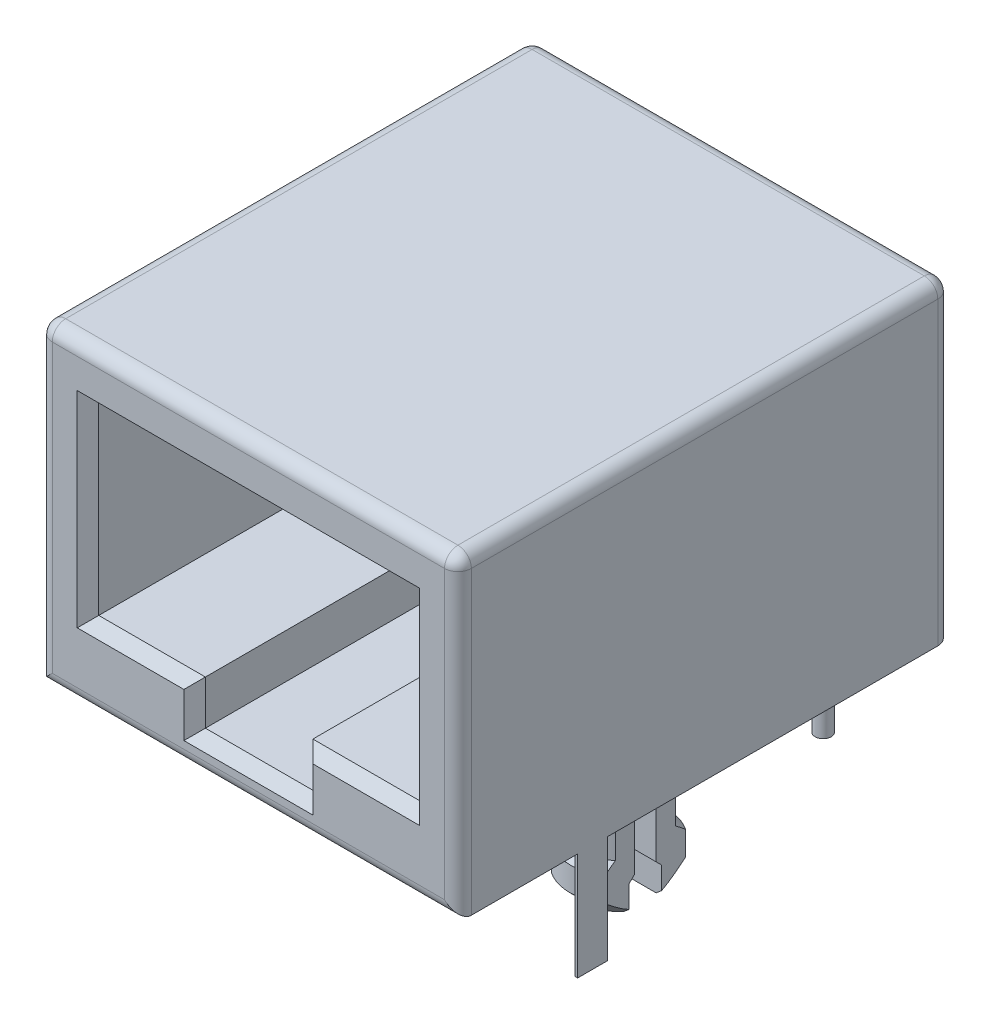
from build123d import *

# Parameters (mm, degrees)
SKETCH_1_W               = 15.6
SKETCH_1_H               = 18.36
EXTRUDE_1_DEPTH          = 11.68
CUT_EXTRUDE_1_DEPTH      = 12
SKETCH_3_R               = 0.3
SKETCH_3_W               = 0.1
SKETCH_3_H               = 1.11
EXTRUDE_2_DEPTH          = 4
CUT_EXTRUDE_2_DEPTH      = 24.116055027
CUT_EXTRUDE_2_DEPTH_BACK = 24.116055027
EXTRUDE_1_2_DEPTH        = 0.3
PATTERN_LINEAR_1_COUNT   = 8
PATTERN_LINEAR_1_PITCH   = 1.27
FILLET_1_R               = 0.5
CHAMFER_1_SIZE           = 0.4


with BuildPart() as part:
    # Sketch 1 → Extrude 1 (new body)
    with BuildSketch(Plane(origin=(0, 0, 0), x_dir=(1, 0, 0), z_dir=(0, 1, 0))):
        with Locations((0, 9.18)):
            Rectangle(SKETCH_1_W, SKETCH_1_H)
    extrude(amount=EXTRUDE_1_DEPTH)

    # Sketch 2 → Cut-Extrude 1 (cut)
    with BuildSketch(Plane.XY):
        Polygon((2, 2.83), (5.97, 2.83), (5.97, 9.68), (-5.97, 9.68), (-5.97, 2.83), (-2, 2.83), (-2, 1.18), (2, 1.18), align=None)
    extrude(amount=-CUT_EXTRUDE_1_DEPTH, mode=Mode.SUBTRACT)

    # Sketch 3 → Extrude 2 (add)
    with BuildSketch(Plane.XZ):
        with Locations(Location((4.445, -16.95, 0), (0, 0, 270))):
            Circle(SKETCH_3_R)
        with Locations(Location((1.905, -16.95, 0), (0, 0, 270))):
            Circle(SKETCH_3_R)
        with Locations(Location((-0.635, -16.95, 0), (0, 0, 270))):
            Circle(SKETCH_3_R)
        with Locations(Location((-3.175, -16.95, 0), (0, 0, 270))):
            Circle(SKETCH_3_R)
        with Locations(Location((3.175, -14.41, 0), (0, 0, 270))):
            Circle(SKETCH_3_R)
        with Locations(Location((0.635, -14.41, 0), (0, 0, 270))):
            Circle(SKETCH_3_R)
        with Locations(Location((-1.905, -14.41, 0), (0, 0, 270))):
            Circle(SKETCH_3_R)
        with Locations(Location((-4.445, -14.41, 0), (0, 0, 270))):
            Circle(SKETCH_3_R)
        with Locations((-7.75, -5.01)):
            Rectangle(SKETCH_3_W, SKETCH_3_H)
        with Locations((7.75, -5.01)):
            Rectangle(SKETCH_3_W, SKETCH_3_H)
        with BuildLine():
            Line((6.715, -9.556662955), (6.715, -6.563337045))
            ThreePointArc((6.715, -6.563337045), (5.715, -6.26), (4.715, -6.563337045))
            Line((4.715, -6.563337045), (4.715, -9.556662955))
            ThreePointArc((4.715, -9.556662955), (5.715, -9.86), (6.715, -9.556662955))
        make_face()
        with BuildLine():
            Line((-6.715, -9.556662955), (-6.715, -6.563337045))
            ThreePointArc((-6.715, -6.563337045), (-5.715, -6.26), (-4.715, -6.563337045))
            Line((-4.715, -6.563337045), (-4.715, -9.556662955))
            ThreePointArc((-4.715, -9.556662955), (-5.715, -9.86), (-6.715, -9.556662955))
        make_face()
    extrude(amount=EXTRUDE_2_DEPTH)

    # Sketch 4 → Cut-Revolve 1 (revolve, cut)
    with BuildSketch(Plane(origin=(5.715, 0, -3.0372913), x_dir=(0, 0, -1), z_dir=(1, 0, 0))):
        Polygon((6.5227087, 0), (6.5227087, -2), (6.8227087, -2.3), (6.8227087, -3.2), (6.0227087, -4), (6.0227087, -4.4), (7.0227087, -4.4), (7.0227087, 0), align=None)
    revolve(axis=Axis((5.715, 0, -8.06), (0, -1, 0)), mode=Mode.SUBTRACT)

    # Sketch 5 → Cut-Revolve 2 (revolve, cut)
    with BuildSketch(Plane(origin=(-5.715, 0, 0), x_dir=(0, 0, -1), z_dir=(1, 0, 0))):
        Polygon((9.06, -4.4), (10.06, -4.4), (10.06, 0), (9.56, 0), (9.56, -2), (9.86, -2.3), (9.86, -3.2), (9.06, -4), align=None)
    revolve(axis=Axis((-5.715, -4, -8.06), (0, 1, 0)), mode=Mode.SUBTRACT)

    # Sketch 6 → Cut-Extrude 2 (cut, two sides: drawn at the far end of the back side and taken through both)
    with BuildSketch(Plane(origin=(0, 0, 0), x_dir=(0, 0, -1), z_dir=(1, 0, 0)).offset(-CUT_EXTRUDE_2_DEPTH_BACK)):
        with BuildLine():
            Line((7.46, -4), (7.46, -3))
            Line((7.46, -3), (7.66, -2.8))
            Line((7.66, -2.8), (7.66, -1))
            ThreePointArc((7.66, -1), (8.06, -0.6), (8.46, -1))
            Line((8.46, -1), (8.46, -2.8))
            Line((8.46, -2.8), (8.66, -3))
            Line((8.66, -3), (8.66, -4))
            Line((8.66, -4), (7.46, -4))
        make_face()
    extrude(amount=CUT_EXTRUDE_2_DEPTH + CUT_EXTRUDE_2_DEPTH_BACK, mode=Mode.SUBTRACT)

    # Sketch 7 → Extrude 1 2 (add, symmetric)
    with BuildSketch(Plane(origin=(-4.445, 0, 0), x_dir=(0, 0, -1), z_dir=(1, 0, 0))):
        with BuildLine():
            ThreePointArc((3, 9.68), (3.121177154, 9.25668033), (3.447998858, 8.961602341))
            Line((3.447998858, 8.961602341), (8.479988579, 6.496023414))
            ThreePointArc((8.479988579, 6.496023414), (10.193319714, 5.886675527), (12, 5.68))
            Line((12, 5.68), (12, 6.08))
            ThreePointArc((12, 6.08), (10.283653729, 6.27634175), (8.65598915, 6.855222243))
            Line((8.65598915, 6.855222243), (3.623999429, 9.320801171))
            ThreePointArc((3.623999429, 9.320801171), (3.460588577, 9.468340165), (3.4, 9.68))
            Line((3.4, 9.68), (3, 9.68))
        make_face()
    extrude_1_2 = extrude(amount=EXTRUDE_1_2_DEPTH, both=True)

    # Pattern Linear 1: Extrude 1 2 ×8
    with Locations(*[(i * PATTERN_LINEAR_1_PITCH, 0, 0) for i in range(1, PATTERN_LINEAR_1_COUNT)]):
        add(extrude_1_2)

    # Fillet 1
    fillet_1_edges = [part.edges().sort_by_distance(p)[0] for p in [
        (7.8, 11.68, -9.18),
        (0, 11.68, -18.36),
        (-7.8, 11.68, -9.18),
        (0, 0, 0),
        (0, 11.68, 0),
        (-7.8, 5.84, -18.36),
        (7.8, 5.84, -18.36),
        (7.8, 5.84, 0),
        (-7.8, 5.84, 0),
    ]]
    fillet(fillet_1_edges, radius=FILLET_1_R)

    # Chamfer 1
    chamfer_1_edges = [part.edges().sort_by_distance(p)[0] for p in [
        (-5.97, 6.255, 0),
        (-3.985, 2.83, 0),
        (-2, 2.005, 0),
        (0, 1.18, 0),
        (2, 2.005, 0),
        (3.985, 2.83, 0),
        (5.97, 6.255, 0),
        (0, 9.68, 0),
    ]]
    chamfer(chamfer_1_edges, length=CHAMFER_1_SIZE)


solid = part.part
